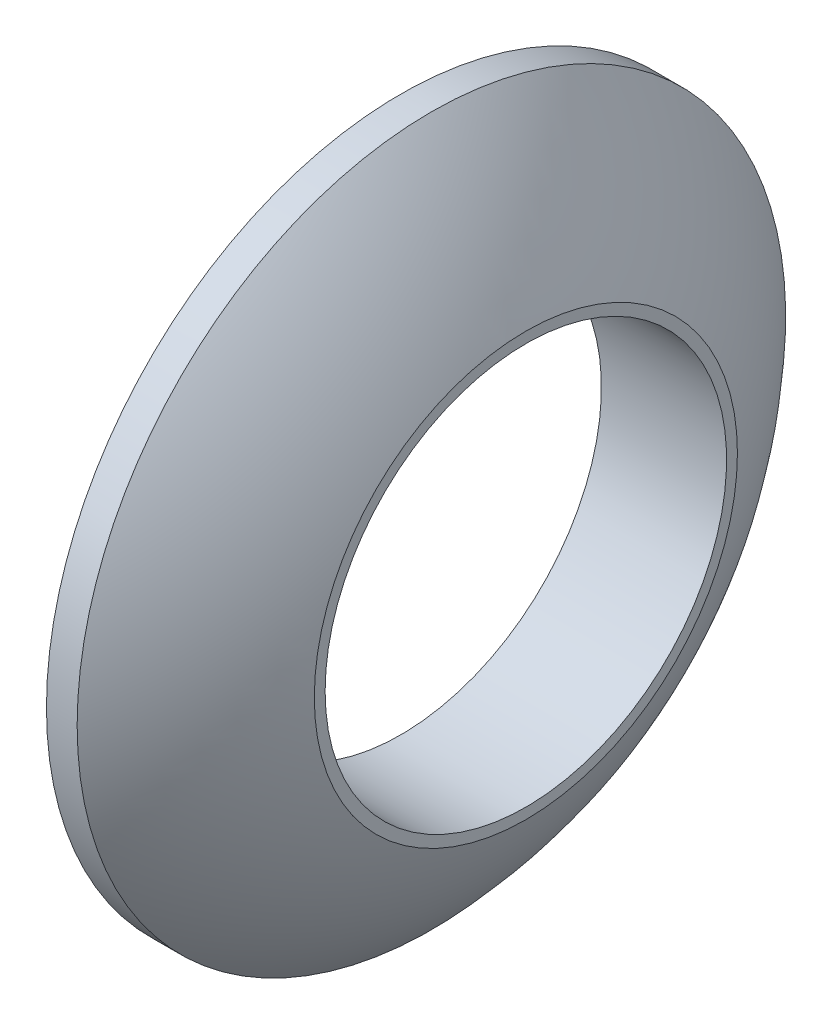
ISO-10303-21;
HEADER;
FILE_DESCRIPTION(('STEP AP214'),'2;1');
FILE_NAME('part.step','',(''),(''),'','','');
FILE_SCHEMA(('AUTOMOTIVE_DESIGN { 1 0 10303 214 1 1 1 1 }'));
ENDSEC;
DATA;
#1=APPLICATION_CONTEXT('core data for automotive mechanical design processes');
#2=APPLICATION_PROTOCOL_DEFINITION('international standard','automotive_design',2000,#1);
#3=PRODUCT_CONTEXT('',#1,'mechanical');
#4=PRODUCT('Part','Part','',(#3));
#5=PRODUCT_RELATED_PRODUCT_CATEGORY('part','',(#4));
#6=PRODUCT_DEFINITION_FORMATION('','',#4);
#7=PRODUCT_DEFINITION_CONTEXT('part definition',#1,'design');
#8=PRODUCT_DEFINITION('design','',#6,#7);
#9=PRODUCT_DEFINITION_SHAPE('','',#8);
#10=(LENGTH_UNIT() NAMED_UNIT(*) SI_UNIT(.MILLI.,.METRE.));
#11=(NAMED_UNIT(*) PLANE_ANGLE_UNIT() SI_UNIT($,.RADIAN.));
#12=(NAMED_UNIT(*) SI_UNIT($,.STERADIAN.) SOLID_ANGLE_UNIT());
#13=UNCERTAINTY_MEASURE_WITH_UNIT(LENGTH_MEASURE(1.E-05),#10,'distance_accuracy_value','');
#14=(GEOMETRIC_REPRESENTATION_CONTEXT(3) GLOBAL_UNCERTAINTY_ASSIGNED_CONTEXT((#13)) GLOBAL_UNIT_ASSIGNED_CONTEXT((#10,
#11,#12)) REPRESENTATION_CONTEXT('',''));
#15=CARTESIAN_POINT('',(0.,0.,0.));
#16=DIRECTION('',(0.,0.,1.));
#17=DIRECTION('',(1.,0.,0.));
#18=AXIS2_PLACEMENT_3D('',#15,#16,#17);
#19=CARTESIAN_POINT('',(-22.9506649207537,0.,0.));
#20=DIRECTION('',(-1.,0.,0.));
#21=DIRECTION('',(0.,0.,1.));
#22=AXIS2_PLACEMENT_3D('',#19,#20,#21);
#23=CYLINDRICAL_SURFACE('',#22,8.5);
#24=CARTESIAN_POINT('',(5.3,0.,0.));
#25=DIRECTION('',(-1.,0.,0.));
#26=DIRECTION('',(0.,0.,1.));
#27=AXIS2_PLACEMENT_3D('',#24,#25,#26);
#28=CIRCLE('',#27,8.5);
#29=CARTESIAN_POINT('',(5.3,0.,8.5));
#30=VERTEX_POINT('',#29);
#31=EDGE_CURVE('E10',#30,#30,#28,.T.);
#32=ORIENTED_EDGE('',*,*,#31,.F.);
#33=EDGE_LOOP('',(#32));
#34=FACE_BOUND('',#33,.T.);
#35=CARTESIAN_POINT('',(0.,0.,0.));
#36=DIRECTION('',(-1.,0.,0.));
#37=DIRECTION('',(0.,0.,1.));
#38=AXIS2_PLACEMENT_3D('',#35,#36,#37);
#39=CIRCLE('',#38,8.5);
#40=CARTESIAN_POINT('',(0.,0.,8.5));
#41=VERTEX_POINT('',#40);
#42=EDGE_CURVE('E49',#41,#41,#39,.T.);
#43=ORIENTED_EDGE('',*,*,#42,.T.);
#44=EDGE_LOOP('',(#43));
#45=FACE_BOUND('',#44,.T.);
#46=ADVANCED_FACE('F30',(#34,#45),#23,.F.);
#47=CARTESIAN_POINT('',(5.3,8.95835835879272,0.));
#48=DIRECTION('',(-1.,0.,0.));
#49=DIRECTION('',(0.,0.,1.));
#50=AXIS2_PLACEMENT_3D('',#47,#48,#49);
#51=PLANE('',#50);
#52=CARTESIAN_POINT('',(5.3,0.,0.));
#53=DIRECTION('',(-1.,0.,0.));
#54=DIRECTION('',(0.,0.,1.));
#55=AXIS2_PLACEMENT_3D('',#52,#53,#54);
#56=CIRCLE('',#55,8.95835835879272);
#57=CARTESIAN_POINT('',(5.3,8.95835835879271,0.));
#58=VERTEX_POINT('',#57);
#59=EDGE_CURVE('E36',#58,#58,#56,.T.);
#60=ORIENTED_EDGE('',*,*,#59,.F.);
#61=EDGE_LOOP('',(#60));
#62=FACE_BOUND('',#61,.T.);
#63=ORIENTED_EDGE('',*,*,#31,.T.);
#64=EDGE_LOOP('',(#63));
#65=FACE_BOUND('',#64,.T.);
#66=ADVANCED_FACE('F68',(#62,#65),#51,.F.);
#67=CARTESIAN_POINT('',(-14.7934769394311,0.,0.));
#68=DIRECTION('',(-1.,0.,0.));
#69=DIRECTION('',(0.,1.,0.));
#70=AXIS2_PLACEMENT_3D('',#67,#68,#69);
#71=SPHERICAL_SURFACE('',#70,22.);
#72=CARTESIAN_POINT('',(1.3,0.,0.));
#73=DIRECTION('',(-1.,0.,0.));
#74=DIRECTION('',(0.,0.,1.));
#75=AXIS2_PLACEMENT_3D('',#72,#73,#74);
#76=CIRCLE('',#75,15.);
#77=CARTESIAN_POINT('',(1.3,15.,0.));
#78=VERTEX_POINT('',#77);
#79=EDGE_CURVE('E40',#78,#78,#76,.T.);
#80=CARTESIAN_POINT('',(1.3,15.,0.));
#81=CARTESIAN_POINT('',(1.3516970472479,14.9445343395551,0.));
#82=CARTESIAN_POINT('',(1.40310733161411,14.8888014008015,0.));
#83=CARTESIAN_POINT('',(1.50534892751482,14.7768069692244,0.));
#84=CARTESIAN_POINT('',(1.55618023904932,14.7205454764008,0.));
#85=CARTESIAN_POINT('',(1.65725844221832,14.6074999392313,0.));
#86=CARTESIAN_POINT('',(1.70750533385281,14.5507158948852,0.));
#87=CARTESIAN_POINT('',(1.80740932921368,14.4366313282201,0.));
#88=CARTESIAN_POINT('',(1.85706643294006,14.379330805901,0.));
#89=CARTESIAN_POINT('',(1.95578554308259,14.2642194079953,0.));
#90=CARTESIAN_POINT('',(2.00484754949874,14.2064085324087,0.));
#91=CARTESIAN_POINT('',(2.10237122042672,14.0902826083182,0.));
#92=CARTESIAN_POINT('',(2.15083288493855,14.0319675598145,0.));
#93=CARTESIAN_POINT('',(2.24715069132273,13.9148395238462,0.));
#94=CARTESIAN_POINT('',(2.29500683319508,13.8560265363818,0.));
#95=CARTESIAN_POINT('',(2.39010847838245,13.7379089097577,0.));
#96=CARTESIAN_POINT('',(2.43735398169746,13.678604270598,0.));
#97=CARTESIAN_POINT('',(2.53122929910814,13.5595096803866,0.));
#98=CARTESIAN_POINT('',(2.57785911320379,13.4997197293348,0.));
#99=CARTESIAN_POINT('',(2.67049806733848,13.3796609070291,0.));
#100=CARTESIAN_POINT('',(2.71650720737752,13.3193920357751,0.));
#101=CARTESIAN_POINT('',(2.80789989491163,13.1983818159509,0.));
#102=CARTESIAN_POINT('',(2.8532834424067,13.1376404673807,0.));
#103=CARTESIAN_POINT('',(2.94342009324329,13.0156917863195,0.));
#104=CARTESIAN_POINT('',(2.98817319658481,12.9544844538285,0.));
#105=CARTESIAN_POINT('',(3.0770441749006,12.8316103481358,0.));
#106=CARTESIAN_POINT('',(3.12116204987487,12.769943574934,0.));
#107=CARTESIAN_POINT('',(3.2087578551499,12.6461571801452,0.));
#108=CARTESIAN_POINT('',(3.25223578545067,12.5840375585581,0.));
#109=CARTESIAN_POINT('',(3.33854705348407,12.4593521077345,0.));
#110=CARTESIAN_POINT('',(3.3813803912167,12.3967862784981,0.));
#111=CARTESIAN_POINT('',(3.46639789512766,12.2712151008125,0.));
#112=CARTESIAN_POINT('',(3.508582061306,12.2082097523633,0.));
#113=CARTESIAN_POINT('',(3.59229671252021,12.0817662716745,0.));
#114=CARTESIAN_POINT('',(3.6338271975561,12.018328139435,0.));
#115=CARTESIAN_POINT('',(3.71623004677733,11.8910258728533,0.));
#116=CARTESIAN_POINT('',(3.75710241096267,11.8271617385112,0.));
#117=CARTESIAN_POINT('',(3.83818464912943,11.6990142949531,0.));
#118=CARTESIAN_POINT('',(3.87839452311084,11.6347309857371,0.));
#119=CARTESIAN_POINT('',(3.95814748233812,11.5057520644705,0.));
#120=CARTESIAN_POINT('',(3.99769056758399,11.44105645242,0.));
#121=CARTESIAN_POINT('',(4.07610572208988,11.3112598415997,0.));
#122=CARTESIAN_POINT('',(4.11497779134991,11.2461588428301,0.));
#123=CARTESIAN_POINT('',(4.19204675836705,11.115558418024,0.));
#124=CARTESIAN_POINT('',(4.23024365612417,11.0500589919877,0.));
#125=CARTESIAN_POINT('',(4.30595819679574,10.9186687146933,0.));
#126=CARTESIAN_POINT('',(4.34347583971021,10.8527778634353,0.));
#127=CARTESIAN_POINT('',(4.41782785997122,10.7206117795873,0.));
#128=CARTESIAN_POINT('',(4.45466223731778,10.6543365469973,0.));
#129=CARTESIAN_POINT('',(4.52764378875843,10.5214087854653,0.));
#130=CARTESIAN_POINT('',(4.56379096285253,10.4547562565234,0.));
#131=CARTESIAN_POINT('',(4.63539424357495,10.3210810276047,0.));
#132=CARTESIAN_POINT('',(4.67085035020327,10.2540583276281,0.));
#133=CARTESIAN_POINT('',(4.74106770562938,10.1196499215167,0.));
#134=CARTESIAN_POINT('',(4.77582895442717,10.052264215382,0.));
#135=CARTESIAN_POINT('',(4.84465287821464,9.91713700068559,0.));
#136=CARTESIAN_POINT('',(4.87871555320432,9.84939549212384,0.));
#137=CARTESIAN_POINT('',(4.94613868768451,9.71356391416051,0.));
#138=CARTESIAN_POINT('',(4.97949914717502,9.64547384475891,0.));
#139=CARTESIAN_POINT('',(5.04551428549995,9.50895242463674,0.));
#140=CARTESIAN_POINT('',(5.07816896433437,9.44052107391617,0.));
#141=CARTESIAN_POINT('',(5.14276904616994,9.30332440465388,0.));
#142=CARTESIAN_POINT('',(5.17471444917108,9.23455908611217,0.));
#143=CARTESIAN_POINT('',(5.23789258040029,9.09670183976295,0.));
#144=CARTESIAN_POINT('',(5.26912530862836,9.02760991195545,0.));
#145=CARTESIAN_POINT('',(5.3,8.95835835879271,0.));
#146=B_SPLINE_CURVE_WITH_KNOTS('',3,(#80,#81,#82,#83,#84,#85,#86,#87,#88,#89,#90,#91,#92,#93,
#94,#95,#96,#97,#98,#99,#100,#101,#102,#103,#104,#105,#106,#107,#108,#109,#110,#111,#112,#113,
#114,#115,#116,#117,#118,#119,#120,#121,#122,#123,#124,#125,#126,#127,#128,#129,#130,#131,#132,
#133,#134,#135,#136,#137,#138,#139,#140,#141,#142,#143,#144,#145),.UNSPECIFIED.,.F.,.F.,(4,2,2,
2,2,2,2,2,2,2,2,2,2,2,2,2,2,2,2,2,2,2,2,2,2,2,2,2,2,2,2,2,4),(0.,0.227465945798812,
0.454931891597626,0.68239783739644,0.909863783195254,1.13732972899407,1.36479567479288,
1.5922616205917,1.81972756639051,2.04719351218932,2.27465945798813,2.50212540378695,
2.72959134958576,2.95705729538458,3.18452324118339,3.41198918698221,3.63945513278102,
3.86692107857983,4.09438702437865,4.32185297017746,4.54931891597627,4.77678486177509,
5.0042508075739,5.23171675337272,5.45918269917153,5.68664864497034,5.91411459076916,
6.14158053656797,6.36904648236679,6.5965124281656,6.82397837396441,7.05144431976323,
7.27891026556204),.UNSPECIFIED.);
#147=EDGE_CURVE('BSEAM63',#78,#58,#146,.T.);
#148=ORIENTED_EDGE('',*,*,#79,.F.);
#149=ORIENTED_EDGE('',*,*,#59,.T.);
#150=ORIENTED_EDGE('',*,*,#147,.T.);
#151=ORIENTED_EDGE('',*,*,#147,.F.);
#152=EDGE_LOOP('',(#148,#150,#149,#151));
#153=FACE_BOUND('',#152,.T.);
#154=ADVANCED_FACE('F63',(#153),#71,.T.);
#155=CARTESIAN_POINT('',(-22.9506649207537,0.,0.));
#156=DIRECTION('',(-1.,0.,0.));
#157=DIRECTION('',(0.,0.,1.));
#158=AXIS2_PLACEMENT_3D('',#155,#156,#157);
#159=CYLINDRICAL_SURFACE('',#158,15.);
#160=CARTESIAN_POINT('',(0.,0.,0.));
#161=DIRECTION('',(-1.,0.,0.));
#162=DIRECTION('',(0.,0.,1.));
#163=AXIS2_PLACEMENT_3D('',#160,#161,#162);
#164=CIRCLE('',#163,15.);
#165=CARTESIAN_POINT('',(0.,0.,15.));
#166=VERTEX_POINT('',#165);
#167=EDGE_CURVE('E44',#166,#166,#164,.T.);
#168=ORIENTED_EDGE('',*,*,#167,.F.);
#169=EDGE_LOOP('',(#168));
#170=FACE_BOUND('',#169,.T.);
#171=ORIENTED_EDGE('',*,*,#79,.T.);
#172=EDGE_LOOP('',(#171));
#173=FACE_BOUND('',#172,.T.);
#174=ADVANCED_FACE('F57',(#170,#173),#159,.T.);
#175=CARTESIAN_POINT('',(0.,8.5,0.));
#176=DIRECTION('',(1.,0.,0.));
#177=DIRECTION('',(0.,0.,-1.));
#178=AXIS2_PLACEMENT_3D('',#175,#176,#177);
#179=PLANE('',#178);
#180=ORIENTED_EDGE('',*,*,#42,.F.);
#181=EDGE_LOOP('',(#180));
#182=FACE_BOUND('',#181,.T.);
#183=ORIENTED_EDGE('',*,*,#167,.T.);
#184=EDGE_LOOP('',(#183));
#185=FACE_BOUND('',#184,.T.);
#186=ADVANCED_FACE('F54',(#182,#185),#179,.F.);
#187=CLOSED_SHELL('',(#46,#66,#154,#174,#186));
#188=MANIFOLD_SOLID_BREP('B2',#187);
#189=ADVANCED_BREP_SHAPE_REPRESENTATION('',(#18,#188),#14);
#190=SHAPE_DEFINITION_REPRESENTATION(#9,#189);
ENDSEC;
END-ISO-10303-21;
